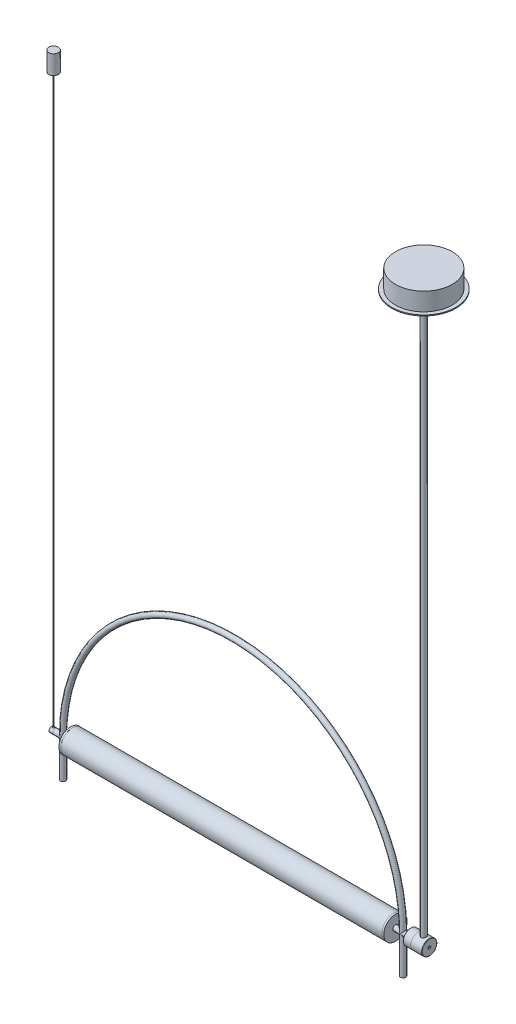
from build123d import *

# Parameters (mm, degrees)
BARRER1_PROFILE_R        = 7
BARRER2_PROFILE_R        = 7
CROQUIS29_R              = 31
SALIENTE_EXTRUIR1_DEPTH  = 5
VACIADO1_T               = -1
SALIENTE_EXTRUIR2_REACH  = 1010.965
CROQUIS30_R              = 30.888524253
CROQUIS30_R_2            = 28.888524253
CROQUIS32_R              = 20
SALIENTE_EXTRUIR3_DEPTH  = 20
CROQUIS33_R              = 20
SALIENTE_EXTRUIR4_DEPTH  = 30
CROQUIS34_R              = 7
SALIENTE_EXTRUIR5_DEPTH  = 1500
REDONDEO1_R              = 1
REDONDEO2_R              = 1
CROQUIS64_R              = 7
SALIENTE_EXTRUIR6_DEPTH  = 10
CROQUIS65_R              = 2
SALIENTE_EXTRUIR7_DEPTH  = 10
CROQUIS66_R              = 1
SALIENTE_EXTRUIR8_DEPTH  = 1500
CROQUIS67_R              = 84.963
SALIENTE_EXTRUIR9_DEPTH  = 2.54
CROQUIS68_R              = 75.057
SALIENTE_EXTRUIR10_DEPTH = 47.498
CROQUIS69_R              = 12.7
SALIENTE_EXTRUIR11_DEPTH = 50.038


with BuildPart() as part:
    # Barrer1: sweep along a path in Croquis1
    with BuildLine(Plane.XY) as barrer1_path:
        Line((-450, -100), (-450, 0))
        ThreePointArc((-450, 0), (0, 450), (450, 0))
        Line((450, 0), (450, -100))
    # Barrer1 profile (on start of the path) → Barrer1 (sweep)
    with BuildSketch(Plane(origin=(-450, -100, 0), x_dir=(0, 0, 1), z_dir=(0, 1, 0))):
        Circle(BARRER1_PROFILE_R)
    sweep(path=barrer1_path.line)

    # Barrer2: sweep along a path in Croquis14
    with BuildLine(Plane.XY) as barrer2_path:
        Line((-430, 0), (-450, 0))
        Line((-450, 0), (-470, 0))
    # Barrer2 profile (on start of the path) → Barrer2 (sweep)
    with BuildSketch(Plane(origin=(-430, 0, 0), x_dir=(0, 0, -1), z_dir=(-1, 0, 0))):
        Circle(BARRER2_PROFILE_R)
    barrer2 = sweep(path=barrer2_path.line)

    # Simetr_a1: Barrer2 across plane
    add(barrer2.mirror(Plane(origin=(0, 0, 0), x_dir=(0, 0, 1), z_dir=(1, 0, 0))))


with BuildPart() as body_2:
    # Croquis29 → Saliente-Extruir1 (new body)
    with BuildSketch(Plane(origin=(-430, 0, 0), x_dir=(0, 0, -1), z_dir=(1, 0, 0))):
        with Locations(Location((0, 0, 0), (0, 0, 90))):
            Circle(CROQUIS29_R)
    extrude(amount=SALIENTE_EXTRUIR1_DEPTH)

    # Vaciado1
    vaciado1_openings = [body_2.faces().sort_by_distance(p)[0] for p in [
        (-425, 0, 0),
    ]]
    offset(amount=VACIADO1_T, openings=vaciado1_openings, kind=Kind.INTERSECTION)


with BuildPart() as body_3:
    # Simetr_a4: mirrored copy
    add(body_2.part.mirror(Plane(origin=(0, 0, 0), x_dir=(0, 0, 1), z_dir=(1, 0, 0))))


with BuildPart() as body_4:

    # Croquis30 → Saliente-Extruir2 (new, up to next)
    with BuildSketch(Plane(origin=(-429, 0, 0), x_dir=(0, 0, -1), z_dir=(1, 0, 0)), mode=Mode.PRIVATE) as saliente_extruir2_sk1:
        with Locations(Location((0, 0, 0), (0, 0, 270))):
            Circle(CROQUIS30_R)
        with Locations(Location((0, 0, 0), (0, 0, 270))):
            Circle(CROQUIS30_R_2, mode=Mode.SUBTRACT)
    saliente_extruir2_tool1 = extrude(saliente_extruir2_sk1.sketch, amount=SALIENTE_EXTRUIR2_REACH, mode=Mode.PRIVATE) - body_3.part
    add(saliente_extruir2_tool1.solids().sort_by_distance((-429, 30.014865, 0))[0])


with BuildPart() as body_5:
    # Croquis32 → Saliente-Extruir3 (new body)
    with BuildSketch(Plane(origin=(470, 0, 0), x_dir=(0, 0, -1), z_dir=(1, 0, 0))):
        with Locations(Location((0, 0, 0), (0, 0, 90))):
            Circle(CROQUIS32_R)
    extrude(amount=SALIENTE_EXTRUIR3_DEPTH)

    # Redondeo2
    redondeo2_edges = [body_5.edges().sort_by_distance(p)[0] for p in [
        (470, -20, 0),
    ]]
    fillet(redondeo2_edges, radius=REDONDEO2_R)


with BuildPart() as body_6:
    # Croquis33 → Saliente-Extruir4 (new body)
    with BuildSketch(Plane(origin=(490, 0, 0), x_dir=(0, 0, -1), z_dir=(1, 0, 0))):
        with Locations(Location((0, 0, 0), (0, 0, 90))):
            Circle(CROQUIS33_R)
    extrude(amount=SALIENTE_EXTRUIR4_DEPTH)

    # Croquis34 → Saliente-Extruir5 (add)
    with BuildSketch(Plane(origin=(0, 0, 0), x_dir=(1, 0, 0), z_dir=(0, 1, 0))):
        with Locations(Location((505, 0, 0), (0, 0, 90))):
            Circle(CROQUIS34_R)
    extrude(amount=SALIENTE_EXTRUIR5_DEPTH)

    # Redondeo1
    redondeo1_edges = [body_6.edges().sort_by_distance(p)[0] for p in [
        (520, -20, 0),
    ]]
    fillet(redondeo1_edges, radius=REDONDEO1_R)


with BuildPart() as avellanado_para_tornillo_con_cabeza_oval_tool:
    # Croquis62 → Avellanado para tornillo con cabeza oval (revolve)
    with BuildSketch(Plane(origin=(520, 0, 0), x_dir=(0, 0, -1), z_dir=(0, 1, 0))):
        Polygon((0, 0), (0, 51.140824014), (1.89865, 50), (1.89865, 1.891953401), (3.5433, 0), align=None)
    revolve(axis=Axis((526.35, 0, 0), (-1, 0, 0)))


with BuildPart() as body_5_1:
    add(body_5.part)

    # Avellanado para tornillo con cabeza oval: cut by avellanado_para_tornillo_con_cabeza_oval_tool
    add(avellanado_para_tornillo_con_cabeza_oval_tool.part, mode=Mode.SUBTRACT)


with BuildPart() as body_6_1:
    add(body_6.part)

    # Avellanado para tornillo con cabeza oval: cut by avellanado_para_tornillo_con_cabeza_oval_tool
    add(avellanado_para_tornillo_con_cabeza_oval_tool.part, mode=Mode.SUBTRACT)

    # Croquis67 → Saliente-Extruir9 (add)
    with BuildSketch(Plane(origin=(0, 1500, 0), x_dir=(1, 0, 0), z_dir=(0, 1, 0))):
        with Locations(Location((505, 0, 0), (0, 0, 270))):
            Circle(CROQUIS67_R)
    extrude(amount=SALIENTE_EXTRUIR9_DEPTH)

    # Croquis68 → Saliente-Extruir10 (add)
    with BuildSketch(Plane(origin=(0, 1502.54, 0), x_dir=(1, 0, 0), z_dir=(0, 1, 0))):
        with Locations(Location((505, 0, 0), (0, 0, 90))):
            Circle(CROQUIS68_R)
    extrude(amount=SALIENTE_EXTRUIR10_DEPTH)


with BuildPart() as body_7:
    # Croquis64 → Saliente-Extruir6 (new body)
    with BuildSketch(Plane.ZY.offset(470)):
        with Locations(Location((0, 0, 0), (0, 0, 270))):
            Circle(CROQUIS64_R)
    extrude(amount=SALIENTE_EXTRUIR6_DEPTH)

    # Croquis65 → Saliente-Extruir7 (add)
    with BuildSketch(Plane(origin=(0, 0, 0), x_dir=(1, 0, 0), z_dir=(0, 1, 0))):
        with Locations(Location((-475, 0, 0), (0, 0, 180))):
            Circle(CROQUIS65_R)
    extrude(amount=SALIENTE_EXTRUIR7_DEPTH)


with BuildPart() as body_8:
    # Croquis66 → Saliente-Extruir8 (new body)
    with BuildSketch(Plane(origin=(0, 10, 0), x_dir=(1, 0, 0), z_dir=(0, 1, 0))):
        with Locations(Location((-475, 0, 0), (0, 0, 270))):
            Circle(CROQUIS66_R)
    extrude(amount=SALIENTE_EXTRUIR8_DEPTH)

    # Croquis69 → Saliente-Extruir11 (add)
    with BuildSketch(Plane(origin=(0, 1510, 0), x_dir=(1, 0, 0), z_dir=(0, 1, 0))):
        with Locations(Location((-475, 0, 0), (0, 0, 270))):
            Circle(CROQUIS69_R)
    extrude(amount=SALIENTE_EXTRUIR11_DEPTH)


solid = Compound([part.part, body_2.part, body_3.part, body_4.part, body_5_1.part, body_6_1.part, body_7.part, body_8.part])
